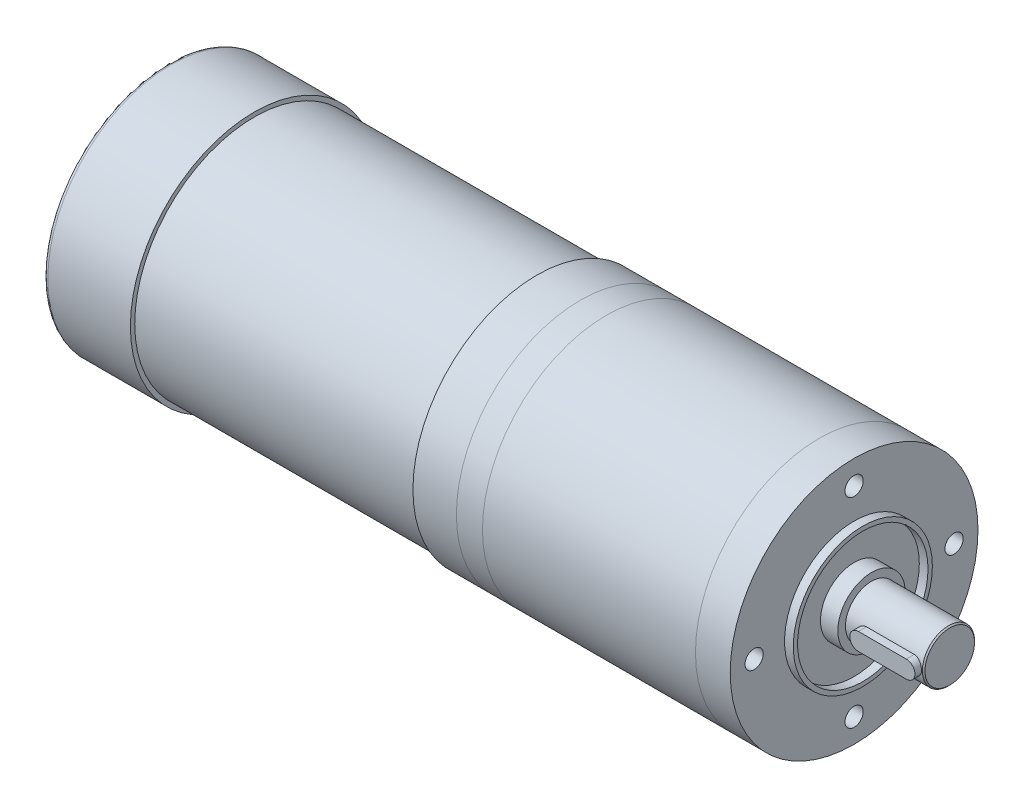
from build123d import *

# Parameters (mm, degrees)
SKETCH_1_R                  = 28.5
EXTRUDE_1_DEPTH             = 8
SKETCH_2_R                  = 28.5
EXTRUDE_2_DEPTH             = 49
SKETCH_3_R                  = 28.5
EXTRUDE_3_DEPTH             = 6
SKETCH_4_R                  = 28.5
EXTRUDE_4_DEPTH             = 10
SKETCH_5_R                  = 27.5
EXTRUDE_5_DEPTH             = 65
SKETCH_6_R                  = 28.5
EXTRUDE_6_DEPTH             = 20
FILLET_1_R                  = 1
SKETCH_7_R                  = 16
SKETCH_7_R_2                = 15
EXTRUDE_7_DEPTH             = 2
SKETCH_8_R                  = 7.75
EXTRUDE_8_DEPTH             = 4
SKETCH_9_R                  = 6
EXTRUDE_9_DEPTH             = 18
HOLE_WIZARD_M5_1_AT_2_COUNT = 2
HOLE_WIZARD_M5_1_AT_2_PITCH = 32.526911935
HOLE_WIZARD_M5_1_AT_3_COUNT = 2
HOLE_WIZARD_M5_1_AT_3_PITCH = 46
HOLE_WIZARD_M5_1_AT_4_COUNT = 2
HOLE_WIZARD_M5_1_AT_4_PITCH = 32.526911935
CUT_EXTRUDE_1_DEPTH         = 2.5
EXTRUDE_10_DEPTH            = 4
CHAMFER_1_SIZE              = 0.3


with BuildPart() as part:
    # Sketch 1 → Extrude 1 (new body)
    with BuildSketch(Plane(origin=(0, 0, 0), x_dir=(0, 0, -1), z_dir=(1, 0, 0))):
        Circle(SKETCH_1_R)
    extrude(amount=-EXTRUDE_1_DEPTH)

    # Sketch 7 → Extrude 7 (add)
    with BuildSketch(Plane(origin=(0, 0, 0), x_dir=(0, 0, -1), z_dir=(1, 0, 0))):
        Circle(SKETCH_7_R)
        Circle(SKETCH_7_R_2, mode=Mode.SUBTRACT)
    extrude(amount=EXTRUDE_7_DEPTH)

    # Sketch 8 → Extrude 8 (add)
    with BuildSketch(Plane(origin=(0, 0, 0), x_dir=(0, 0, -1), z_dir=(1, 0, 0))):
        Circle(SKETCH_8_R)
    extrude(amount=EXTRUDE_8_DEPTH)

    # Sketch 9 → Extrude 9 (add)
    with BuildSketch(Plane(origin=(4, 0, 0), x_dir=(0, 0, -1), z_dir=(1, 0, 0))):
        Circle(SKETCH_9_R)
    extrude(amount=EXTRUDE_9_DEPTH)


with BuildPart() as body_2:
    # Sketch 2 → Extrude 2 (new body)
    with BuildSketch(Plane.ZY.offset(8)):
        Circle(SKETCH_2_R)
    extrude(amount=EXTRUDE_2_DEPTH)


with BuildPart() as body_3:
    # Sketch 3 → Extrude 3 (new body)
    with BuildSketch(Plane.ZY.offset(57)):
        Circle(SKETCH_3_R)
    extrude(amount=EXTRUDE_3_DEPTH)


with BuildPart() as body_4:
    # Sketch 4 → Extrude 4 (new body)
    with BuildSketch(Plane.ZY.offset(63)):
        Circle(SKETCH_4_R)
    extrude(amount=EXTRUDE_4_DEPTH)

    # Sketch 5 → Extrude 5 (add)
    with BuildSketch(Plane.ZY.offset(73)):
        Circle(SKETCH_5_R)
    extrude(amount=EXTRUDE_5_DEPTH)

    # Sketch 6 → Extrude 6 (add)
    with BuildSketch(Plane.ZY.offset(138)):
        Circle(SKETCH_6_R)
    extrude(amount=EXTRUDE_6_DEPTH)

    # Fillet 1
    fillet_1_edges = [body_4.edges().sort_by_distance(p)[0] for p in [
        (-158, 0, -28.5),
    ]]
    fillet(fillet_1_edges, radius=FILLET_1_R)


with BuildPart() as hole_wizard_m5_1_tool:
    # Sketch 11 → Hole Wizard M5 _1 (revolve)
    with BuildSketch(Plane(origin=(0, 23, 0), x_dir=(0, 0, -1), z_dir=(0, 1, 0))):
        Polygon((0, 0), (0, 15.2618073), (2.1, 14), (2.1, 0), align=None)
    hole_wizard_m5_1 = revolve(axis=Axis((6.35, 23, 0), (-1, 0, 0)))


with BuildPart() as part_1:
    add(part.part)

    # Hole Wizard M5 _1: cut by hole_wizard_m5_1_tool
    add(hole_wizard_m5_1_tool.part, mode=Mode.SUBTRACT)


with BuildPart() as body_2_1:
    add(body_2.part)

    # Hole Wizard M5 _1: cut by hole_wizard_m5_1_tool
    add(hole_wizard_m5_1_tool.part, mode=Mode.SUBTRACT)


with BuildPart() as hole_wizard_m5_1_at_2_tool:
    # Hole Wizard M5 _1 at 2: Hole Wizard M5 _1 ×2
    with Locations(*[Vector(0, -0.7071067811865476, -0.7071067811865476) * (i * HOLE_WIZARD_M5_1_AT_2_PITCH) for i in range(1, HOLE_WIZARD_M5_1_AT_2_COUNT)]):
        add(hole_wizard_m5_1)


with BuildPart() as part_2:
    add(part_1.part)

    # Hole Wizard M5 _1 at 2: cut by hole_wizard_m5_1_at_2_tool
    add(hole_wizard_m5_1_at_2_tool.part, mode=Mode.SUBTRACT)


with BuildPart() as body_2_2:
    add(body_2_1.part)

    # Hole Wizard M5 _1 at 2: cut by hole_wizard_m5_1_at_2_tool
    add(hole_wizard_m5_1_at_2_tool.part, mode=Mode.SUBTRACT)


with BuildPart() as hole_wizard_m5_1_at_3_tool:
    # Hole Wizard M5 _1 at 3: Hole Wizard M5 _1 ×2
    with Locations(*[(0, -i * HOLE_WIZARD_M5_1_AT_3_PITCH, 0) for i in range(1, HOLE_WIZARD_M5_1_AT_3_COUNT)]):
        add(hole_wizard_m5_1)


with BuildPart() as part_3:
    add(part_2.part)

    # Hole Wizard M5 _1 at 3: cut by hole_wizard_m5_1_at_3_tool
    add(hole_wizard_m5_1_at_3_tool.part, mode=Mode.SUBTRACT)


with BuildPart() as body_2_3:
    add(body_2_2.part)

    # Hole Wizard M5 _1 at 3: cut by hole_wizard_m5_1_at_3_tool
    add(hole_wizard_m5_1_at_3_tool.part, mode=Mode.SUBTRACT)


with BuildPart() as hole_wizard_m5_1_at_4_tool:
    # Hole Wizard M5 _1 at 4: Hole Wizard M5 _1 ×2
    with Locations(*[Vector(0, -0.7071067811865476, 0.7071067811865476) * (i * HOLE_WIZARD_M5_1_AT_4_PITCH) for i in range(1, HOLE_WIZARD_M5_1_AT_4_COUNT)]):
        add(hole_wizard_m5_1)


with BuildPart() as part_4:
    add(part_3.part)

    # Hole Wizard M5 _1 at 4: cut by hole_wizard_m5_1_at_4_tool
    add(hole_wizard_m5_1_at_4_tool.part, mode=Mode.SUBTRACT)

    # Sketch 12 → Cut-Extrude 1 (cut)
    with BuildSketch(Plane.XY.offset(6)):
        with BuildLine():
            Line((8.5, 2), (19.5, 2))
            ThreePointArc((19.5, 2), (21.5, 0), (19.5, -2))
            Line((19.5, -2), (8.5, -2))
            ThreePointArc((8.5, -2), (6.5, 0), (8.5, 2))
        make_face()
    extrude(amount=-CUT_EXTRUDE_1_DEPTH, mode=Mode.SUBTRACT)

    # Chamfer 1
    chamfer_1_edges = [part_4.edges().sort_by_distance(p)[0] for p in [
        (22, 0, 6),
    ]]
    chamfer(chamfer_1_edges, length=CHAMFER_1_SIZE)


with BuildPart() as body_2_4:
    add(body_2_3.part)

    # Hole Wizard M5 _1 at 4: cut by hole_wizard_m5_1_at_4_tool
    add(hole_wizard_m5_1_at_4_tool.part, mode=Mode.SUBTRACT)


with BuildPart() as body_5:
    # Sketch 13 → Extrude 10 (new body)
    with BuildSketch(Plane.XY.offset(3.5)):
        with BuildLine():
            Line((8.5, 2), (19.5, 2))
            ThreePointArc((19.5, 2), (21.5, 0), (19.5, -2))
            Line((19.5, -2), (8.5, -2))
            ThreePointArc((8.5, -2), (6.5, 0), (8.5, 2))
        make_face()
    extrude(amount=EXTRUDE_10_DEPTH)


solid = Compound([body_3.part, body_4.part, part_4.part, body_2_4.part, body_5.part])
